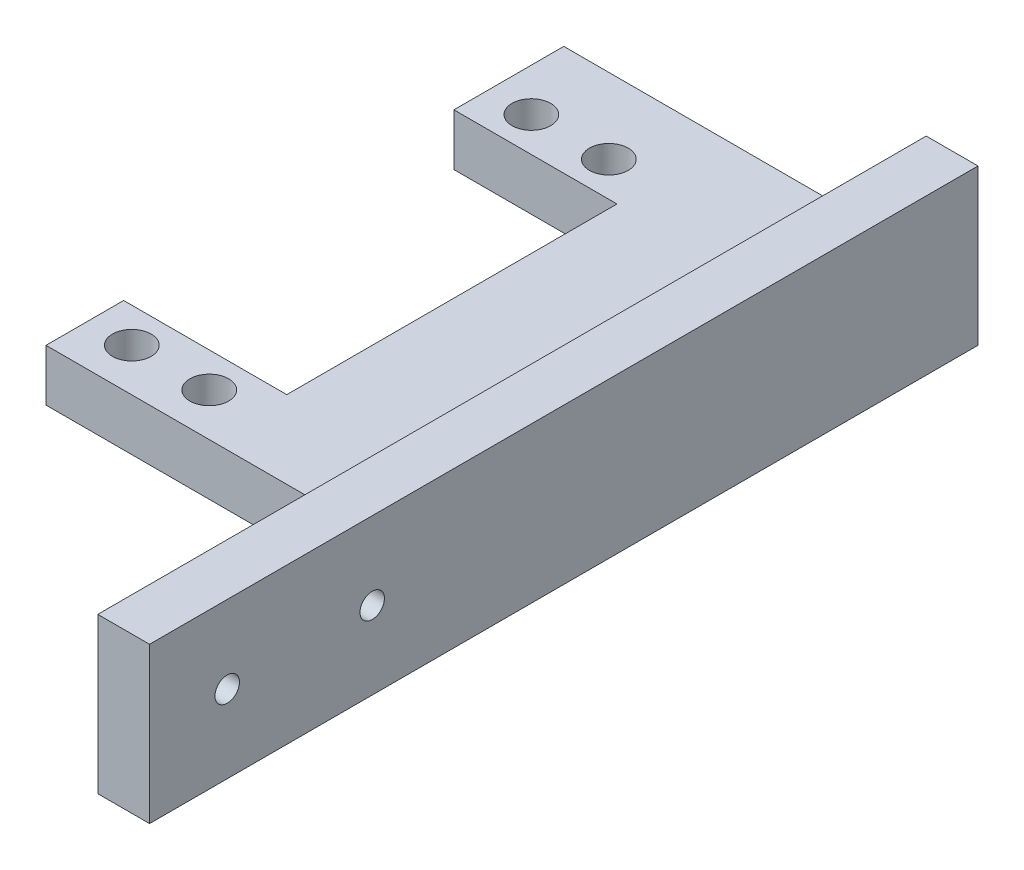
ISO-10303-21;
HEADER;
FILE_DESCRIPTION(('STEP AP214'),'2;1');
FILE_NAME('part.step','',(''),(''),'','','');
FILE_SCHEMA(('AUTOMOTIVE_DESIGN { 1 0 10303 214 1 1 1 1 }'));
ENDSEC;
DATA;
#1=APPLICATION_CONTEXT('core data for automotive mechanical design processes');
#2=APPLICATION_PROTOCOL_DEFINITION('international standard','automotive_design',2000,#1);
#3=PRODUCT_CONTEXT('',#1,'mechanical');
#4=PRODUCT('Part','Part','',(#3));
#5=PRODUCT_RELATED_PRODUCT_CATEGORY('part','',(#4));
#6=PRODUCT_DEFINITION_FORMATION('','',#4);
#7=PRODUCT_DEFINITION_CONTEXT('part definition',#1,'design');
#8=PRODUCT_DEFINITION('design','',#6,#7);
#9=PRODUCT_DEFINITION_SHAPE('','',#8);
#10=(LENGTH_UNIT() NAMED_UNIT(*) SI_UNIT(.MILLI.,.METRE.));
#11=(NAMED_UNIT(*) PLANE_ANGLE_UNIT() SI_UNIT($,.RADIAN.));
#12=(NAMED_UNIT(*) SI_UNIT($,.STERADIAN.) SOLID_ANGLE_UNIT());
#13=UNCERTAINTY_MEASURE_WITH_UNIT(LENGTH_MEASURE(1.E-05),#10,'distance_accuracy_value','');
#14=(GEOMETRIC_REPRESENTATION_CONTEXT(3) GLOBAL_UNCERTAINTY_ASSIGNED_CONTEXT((#13)) GLOBAL_UNIT_ASSIGNED_CONTEXT((#10,
#11,#12)) REPRESENTATION_CONTEXT('',''));
#15=CARTESIAN_POINT('',(0.,0.,0.));
#16=DIRECTION('',(0.,0.,1.));
#17=DIRECTION('',(1.,0.,0.));
#18=AXIS2_PLACEMENT_3D('',#15,#16,#17);
#19=CARTESIAN_POINT('',(-44.45,0.,0.));
#20=DIRECTION('',(1.,0.,0.));
#21=DIRECTION('',(0.,0.,-1.));
#22=AXIS2_PLACEMENT_3D('',#19,#20,#21);
#23=PLANE('',#22);
#24=DIRECTION('',(0.,0.,-1.));
#25=VECTOR('',#24,1.);
#26=CARTESIAN_POINT('',(-44.45,-9.52500000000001,-92.075));
#27=LINE('',#26,#25);
#28=CARTESIAN_POINT('',(-44.45,-9.52500000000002,-78.600000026));
#29=VERTEX_POINT('',#28);
#30=CARTESIAN_POINT('',(-44.45,-9.52500000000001,-92.075));
#31=VERTEX_POINT('',#30);
#32=EDGE_CURVE('E188',#29,#31,#27,.T.);
#33=ORIENTED_EDGE('',*,*,#32,.F.);
#34=DIRECTION('',(0.,1.,0.));
#35=VECTOR('',#34,1.);
#36=CARTESIAN_POINT('',(-44.45,-9.52500000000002,-78.600000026));
#37=LINE('',#36,#35);
#38=CARTESIAN_POINT('',(-44.45,-3.17500000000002,-78.600000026));
#39=VERTEX_POINT('',#38);
#40=EDGE_CURVE('E167',#29,#39,#37,.T.);
#41=ORIENTED_EDGE('',*,*,#40,.T.);
#42=DIRECTION('',(0.,0.,1.));
#43=VECTOR('',#42,1.);
#44=CARTESIAN_POINT('',(-44.45,-3.17500000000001,-92.075));
#45=LINE('',#44,#43);
#46=CARTESIAN_POINT('',(-44.45,-3.17500000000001,-92.075));
#47=VERTEX_POINT('',#46);
#48=EDGE_CURVE('E180',#47,#39,#45,.T.);
#49=ORIENTED_EDGE('',*,*,#48,.F.);
#50=DIRECTION('',(0.,1.,0.));
#51=VECTOR('',#50,1.);
#52=CARTESIAN_POINT('',(-44.45,-9.52500000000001,-92.075));
#53=LINE('',#52,#51);
#54=EDGE_CURVE('E171',#31,#47,#53,.T.);
#55=ORIENTED_EDGE('',*,*,#54,.F.);
#56=EDGE_LOOP('',(#33,#41,#49,#55));
#57=FACE_BOUND('',#56,.T.);
#58=ADVANCED_FACE('F43',(#57),#23,.F.);
#59=CARTESIAN_POINT('',(6.35,0.,0.));
#60=DIRECTION('',(-1.,0.,0.));
#61=DIRECTION('',(0.,0.,1.));
#62=AXIS2_PLACEMENT_3D('',#59,#60,#61);
#63=PLANE('',#62);
#64=DIRECTION('',(0.,0.,-1.));
#65=VECTOR('',#64,1.);
#66=CARTESIAN_POINT('',(6.35,-9.52500000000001,-92.075));
#67=LINE('',#66,#65);
#68=CARTESIAN_POINT('',(6.35,-9.52500000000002,9.525));
#69=VERTEX_POINT('',#68);
#70=CARTESIAN_POINT('',(6.35,-9.52500000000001,-92.075));
#71=VERTEX_POINT('',#70);
#72=EDGE_CURVE('E229',#69,#71,#67,.T.);
#73=ORIENTED_EDGE('',*,*,#72,.T.);
#74=DIRECTION('',(0.,1.,0.));
#75=VECTOR('',#74,1.);
#76=CARTESIAN_POINT('',(6.35,9.525,-92.075));
#77=LINE('',#76,#75);
#78=CARTESIAN_POINT('',(6.35,9.525,-92.075));
#79=VERTEX_POINT('',#78);
#80=EDGE_CURVE('E233',#71,#79,#77,.T.);
#81=ORIENTED_EDGE('',*,*,#80,.T.);
#82=DIRECTION('',(0.,0.,1.));
#83=VECTOR('',#82,1.);
#84=CARTESIAN_POINT('',(6.35,9.525,-92.075));
#85=LINE('',#84,#83);
#86=CARTESIAN_POINT('',(6.35,9.52499999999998,9.525));
#87=VERTEX_POINT('',#86);
#88=EDGE_CURVE('E236',#79,#87,#85,.T.);
#89=ORIENTED_EDGE('',*,*,#88,.T.);
#90=DIRECTION('',(0.,-1.,0.));
#91=VECTOR('',#90,1.);
#92=CARTESIAN_POINT('',(6.35,9.52499999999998,9.525));
#93=LINE('',#92,#91);
#94=EDGE_CURVE('E225',#87,#69,#93,.T.);
#95=ORIENTED_EDGE('',*,*,#94,.T.);
#96=EDGE_LOOP('',(#73,#81,#89,#95));
#97=FACE_BOUND('',#96,.T.);
#98=CARTESIAN_POINT('',(6.35,0.,0.));
#99=DIRECTION('',(1.,0.,0.));
#100=DIRECTION('',(0.,0.,-1.));
#101=AXIS2_PLACEMENT_3D('',#98,#99,#100);
#102=CIRCLE('',#101,1.5);
#103=CARTESIAN_POINT('',(6.35,0.,-1.5));
#104=VERTEX_POINT('',#103);
#105=EDGE_CURVE('E217',#104,#104,#102,.T.);
#106=ORIENTED_EDGE('',*,*,#105,.F.);
#107=EDGE_LOOP('',(#106));
#108=FACE_BOUND('',#107,.T.);
#109=CARTESIAN_POINT('',(6.35,0.,-17.78));
#110=DIRECTION('',(1.,0.,0.));
#111=DIRECTION('',(0.,0.,-1.));
#112=AXIS2_PLACEMENT_3D('',#109,#110,#111);
#113=CIRCLE('',#112,1.5);
#114=CARTESIAN_POINT('',(6.35,0.,-19.28));
#115=VERTEX_POINT('',#114);
#116=EDGE_CURVE('E209',#115,#115,#113,.T.);
#117=ORIENTED_EDGE('',*,*,#116,.F.);
#118=EDGE_LOOP('',(#117));
#119=FACE_BOUND('',#118,.T.);
#120=ADVANCED_FACE('F284',(#97,#108,#119),#63,.F.);
#121=CARTESIAN_POINT('',(0.,0.,0.));
#122=DIRECTION('',(-1.,0.,0.));
#123=DIRECTION('',(0.,0.,1.));
#124=AXIS2_PLACEMENT_3D('',#121,#122,#123);
#125=PLANE('',#124);
#126=DIRECTION('',(0.,1.,0.));
#127=VECTOR('',#126,1.);
#128=CARTESIAN_POINT('',(0.,0.,-28.575));
#129=LINE('',#128,#127);
#130=CARTESIAN_POINT('',(0.,-9.52500000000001,-28.575));
#131=VERTEX_POINT('',#130);
#132=CARTESIAN_POINT('',(0.,-3.17500000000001,-28.575));
#133=VERTEX_POINT('',#132);
#134=EDGE_CURVE('E205',#131,#133,#129,.T.);
#135=ORIENTED_EDGE('',*,*,#134,.F.);
#136=DIRECTION('',(0.,0.,-1.));
#137=VECTOR('',#136,1.);
#138=CARTESIAN_POINT('',(0.,-9.52500000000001,-92.075));
#139=LINE('',#138,#137);
#140=CARTESIAN_POINT('',(0.,-9.52500000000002,9.525));
#141=VERTEX_POINT('',#140);
#142=EDGE_CURVE('E243',#141,#131,#139,.T.);
#143=ORIENTED_EDGE('',*,*,#142,.F.);
#144=DIRECTION('',(0.,-1.,0.));
#145=VECTOR('',#144,1.);
#146=CARTESIAN_POINT('',(0.,9.52499999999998,9.525));
#147=LINE('',#146,#145);
#148=CARTESIAN_POINT('',(0.,9.52499999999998,9.525));
#149=VERTEX_POINT('',#148);
#150=EDGE_CURVE('E221',#149,#141,#147,.T.);
#151=ORIENTED_EDGE('',*,*,#150,.F.);
#152=DIRECTION('',(0.,0.,1.));
#153=VECTOR('',#152,1.);
#154=CARTESIAN_POINT('',(0.,9.525,-92.075));
#155=LINE('',#154,#153);
#156=CARTESIAN_POINT('',(0.,9.525,-92.075));
#157=VERTEX_POINT('',#156);
#158=EDGE_CURVE('E230',#157,#149,#155,.T.);
#159=ORIENTED_EDGE('',*,*,#158,.F.);
#160=DIRECTION('',(0.,1.,0.));
#161=VECTOR('',#160,1.);
#162=CARTESIAN_POINT('',(0.,9.525,-92.075));
#163=LINE('',#162,#161);
#164=CARTESIAN_POINT('',(0.,-3.17500000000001,-92.075));
#165=VERTEX_POINT('',#164);
#166=EDGE_CURVE('E247',#165,#157,#163,.T.);
#167=ORIENTED_EDGE('',*,*,#166,.F.);
#168=DIRECTION('',(0.,0.,-1.));
#169=VECTOR('',#168,1.);
#170=CARTESIAN_POINT('',(0.,-3.17500000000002,0.));
#171=LINE('',#170,#169);
#172=EDGE_CURVE('E67',#133,#165,#171,.T.);
#173=ORIENTED_EDGE('',*,*,#172,.F.);
#174=EDGE_LOOP('',(#135,#143,#151,#159,#167,#173));
#175=FACE_BOUND('',#174,.T.);
#176=CARTESIAN_POINT('',(0.,0.,0.));
#177=DIRECTION('',(1.,0.,0.));
#178=DIRECTION('',(0.,0.,-1.));
#179=AXIS2_PLACEMENT_3D('',#176,#177,#178);
#180=CIRCLE('',#179,1.5);
#181=CARTESIAN_POINT('',(0.,0.,-1.5));
#182=VERTEX_POINT('',#181);
#183=EDGE_CURVE('E213',#182,#182,#180,.T.);
#184=ORIENTED_EDGE('',*,*,#183,.T.);
#185=EDGE_LOOP('',(#184));
#186=FACE_BOUND('',#185,.T.);
#187=CARTESIAN_POINT('',(0.,0.,-17.78));
#188=DIRECTION('',(1.,0.,0.));
#189=DIRECTION('',(0.,0.,-1.));
#190=AXIS2_PLACEMENT_3D('',#187,#188,#189);
#191=CIRCLE('',#190,1.5);
#192=CARTESIAN_POINT('',(0.,0.,-19.28));
#193=VERTEX_POINT('',#192);
#194=EDGE_CURVE('E208',#193,#193,#191,.T.);
#195=ORIENTED_EDGE('',*,*,#194,.T.);
#196=EDGE_LOOP('',(#195));
#197=FACE_BOUND('',#196,.T.);
#198=ADVANCED_FACE('F278',(#175,#186,#197),#125,.T.);
#199=CARTESIAN_POINT('',(6.35,9.52499999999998,9.525));
#200=DIRECTION('',(0.,0.,-1.));
#201=DIRECTION('',(0.,1.,0.));
#202=AXIS2_PLACEMENT_3D('',#199,#200,#201);
#203=PLANE('',#202);
#204=ORIENTED_EDGE('',*,*,#150,.T.);
#205=DIRECTION('',(-1.,0.,0.));
#206=VECTOR('',#205,1.);
#207=CARTESIAN_POINT('',(6.35,-9.52500000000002,9.525));
#208=LINE('',#207,#206);
#209=EDGE_CURVE('E11',#69,#141,#208,.T.);
#210=ORIENTED_EDGE('',*,*,#209,.F.);
#211=ORIENTED_EDGE('',*,*,#94,.F.);
#212=DIRECTION('',(-1.,0.,0.));
#213=VECTOR('',#212,1.);
#214=CARTESIAN_POINT('',(6.35,9.52499999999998,9.525));
#215=LINE('',#214,#213);
#216=EDGE_CURVE('E239',#87,#149,#215,.T.);
#217=ORIENTED_EDGE('',*,*,#216,.T.);
#218=EDGE_LOOP('',(#204,#210,#211,#217));
#219=FACE_BOUND('',#218,.T.);
#220=ADVANCED_FACE('F45',(#219),#203,.F.);
#221=CARTESIAN_POINT('',(6.35,-9.52500000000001,-92.075));
#222=DIRECTION('',(0.,1.,0.));
#223=DIRECTION('',(0.,0.,1.));
#224=AXIS2_PLACEMENT_3D('',#221,#222,#223);
#225=PLANE('',#224);
#226=CARTESIAN_POINT('',(-39.199999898,-9.52500000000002,-82.850000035));
#227=DIRECTION('',(0.,1.,0.));
#228=DIRECTION('',(0.,0.,-1.));
#229=AXIS2_PLACEMENT_3D('',#226,#227,#228);
#230=CIRCLE('',#229,2.37499994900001);
#231=CARTESIAN_POINT('',(-39.199999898,-9.52500000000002,-85.224999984));
#232=VERTEX_POINT('',#231);
#233=EDGE_CURVE('E157',#232,#232,#230,.T.);
#234=ORIENTED_EDGE('',*,*,#233,.T.);
#235=EDGE_LOOP('',(#234));
#236=FACE_BOUND('',#235,.T.);
#237=CARTESIAN_POINT('',(-29.700000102,-9.52500000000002,-82.850000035));
#238=DIRECTION('',(0.,1.,0.));
#239=DIRECTION('',(0.,0.,1.));
#240=AXIS2_PLACEMENT_3D('',#237,#238,#239);
#241=CIRCLE('',#240,2.374999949);
#242=CARTESIAN_POINT('',(-29.700000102,-9.52500000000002,-80.475000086));
#243=VERTEX_POINT('',#242);
#244=EDGE_CURVE('E342',#243,#243,#241,.T.);
#245=ORIENTED_EDGE('',*,*,#244,.T.);
#246=EDGE_LOOP('',(#245));
#247=FACE_BOUND('',#246,.T.);
#248=CARTESIAN_POINT('',(-29.700000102,-9.52500000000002,-33.849999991));
#249=DIRECTION('',(0.,1.,0.));
#250=DIRECTION('',(0.,0.,-1.));
#251=AXIS2_PLACEMENT_3D('',#248,#249,#250);
#252=CIRCLE('',#251,2.374999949);
#253=CARTESIAN_POINT('',(-29.700000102,-9.52500000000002,-36.22499994));
#254=VERTEX_POINT('',#253);
#255=EDGE_CURVE('E346',#254,#254,#252,.T.);
#256=ORIENTED_EDGE('',*,*,#255,.T.);
#257=EDGE_LOOP('',(#256));
#258=FACE_BOUND('',#257,.T.);
#259=CARTESIAN_POINT('',(-39.199999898,-9.52500000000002,-33.849999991));
#260=DIRECTION('',(0.,1.,0.));
#261=DIRECTION('',(0.,0.,1.));
#262=AXIS2_PLACEMENT_3D('',#259,#260,#261);
#263=CIRCLE('',#262,2.374999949);
#264=CARTESIAN_POINT('',(-39.199999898,-9.52500000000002,-31.475000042));
#265=VERTEX_POINT('',#264);
#266=EDGE_CURVE('E349',#265,#265,#263,.T.);
#267=ORIENTED_EDGE('',*,*,#266,.T.);
#268=EDGE_LOOP('',(#267));
#269=FACE_BOUND('',#268,.T.);
#270=DIRECTION('',(0.,0.,-1.));
#271=VECTOR('',#270,1.);
#272=CARTESIAN_POINT('',(-24.45,-9.52500000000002,-78.600000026));
#273=LINE('',#272,#271);
#274=CARTESIAN_POINT('',(-24.45,-9.52500000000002,-38.1));
#275=VERTEX_POINT('',#274);
#276=CARTESIAN_POINT('',(-24.45,-9.52500000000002,-78.600000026));
#277=VERTEX_POINT('',#276);
#278=EDGE_CURVE('E138',#275,#277,#273,.T.);
#279=ORIENTED_EDGE('',*,*,#278,.T.);
#280=DIRECTION('',(-1.,0.,0.));
#281=VECTOR('',#280,1.);
#282=CARTESIAN_POINT('',(-44.45,-9.52500000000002,-78.600000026));
#283=LINE('',#282,#281);
#284=EDGE_CURVE('E144',#277,#29,#283,.T.);
#285=ORIENTED_EDGE('',*,*,#284,.T.);
#286=ORIENTED_EDGE('',*,*,#32,.T.);
#287=DIRECTION('',(-1.,0.,0.));
#288=VECTOR('',#287,1.);
#289=CARTESIAN_POINT('',(6.35,-9.52500000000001,-92.075));
#290=LINE('',#289,#288);
#291=EDGE_CURVE('E52',#71,#31,#290,.T.);
#292=ORIENTED_EDGE('',*,*,#291,.F.);
#293=ORIENTED_EDGE('',*,*,#72,.F.);
#294=ORIENTED_EDGE('',*,*,#209,.T.);
#295=ORIENTED_EDGE('',*,*,#142,.T.);
#296=DIRECTION('',(1.,0.,0.));
#297=VECTOR('',#296,1.);
#298=CARTESIAN_POINT('',(-44.45,-9.52500000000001,-28.575));
#299=LINE('',#298,#297);
#300=CARTESIAN_POINT('',(-44.45,-9.52500000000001,-28.575));
#301=VERTEX_POINT('',#300);
#302=EDGE_CURVE('E192',#301,#131,#299,.T.);
#303=ORIENTED_EDGE('',*,*,#302,.F.);
#304=CARTESIAN_POINT('',(-44.45,-9.52500000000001,-38.1));
#305=VERTEX_POINT('',#304);
#306=EDGE_CURVE('E149',#301,#305,#27,.T.);
#307=ORIENTED_EDGE('',*,*,#306,.T.);
#308=DIRECTION('',(1.,0.,0.));
#309=VECTOR('',#308,1.);
#310=CARTESIAN_POINT('',(-44.45,-9.52500000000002,-38.1));
#311=LINE('',#310,#309);
#312=EDGE_CURVE('E59',#305,#275,#311,.T.);
#313=ORIENTED_EDGE('',*,*,#312,.T.);
#314=EDGE_LOOP('',(#279,#285,#286,#292,#293,#294,#295,#303,#307,#313));
#315=FACE_BOUND('',#314,.T.);
#316=ADVANCED_FACE('F147',(#236,#247,#258,#269,#315),#225,.F.);
#317=CARTESIAN_POINT('',(6.35,9.525,-92.075));
#318=DIRECTION('',(0.,0.,1.));
#319=DIRECTION('',(1.,0.,0.));
#320=AXIS2_PLACEMENT_3D('',#317,#318,#319);
#321=PLANE('',#320);
#322=DIRECTION('',(-1.,0.,0.));
#323=VECTOR('',#322,1.);
#324=CARTESIAN_POINT('',(6.35,9.525,-92.075));
#325=LINE('',#324,#323);
#326=EDGE_CURVE('E255',#79,#157,#325,.T.);
#327=ORIENTED_EDGE('',*,*,#326,.F.);
#328=ORIENTED_EDGE('',*,*,#80,.F.);
#329=ORIENTED_EDGE('',*,*,#291,.T.);
#330=ORIENTED_EDGE('',*,*,#54,.T.);
#331=DIRECTION('',(1.,0.,0.));
#332=VECTOR('',#331,1.);
#333=CARTESIAN_POINT('',(-44.45,-3.17500000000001,-92.075));
#334=LINE('',#333,#332);
#335=EDGE_CURVE('E191',#47,#165,#334,.T.);
#336=ORIENTED_EDGE('',*,*,#335,.T.);
#337=ORIENTED_EDGE('',*,*,#166,.T.);
#338=EDGE_LOOP('',(#327,#328,#329,#330,#336,#337));
#339=FACE_BOUND('',#338,.T.);
#340=ADVANCED_FACE('F265',(#339),#321,.F.);
#341=CARTESIAN_POINT('',(6.35,9.525,-92.075));
#342=DIRECTION('',(0.,-1.,0.));
#343=DIRECTION('',(0.,0.,-1.));
#344=AXIS2_PLACEMENT_3D('',#341,#342,#343);
#345=PLANE('',#344);
#346=ORIENTED_EDGE('',*,*,#158,.T.);
#347=ORIENTED_EDGE('',*,*,#216,.F.);
#348=ORIENTED_EDGE('',*,*,#88,.F.);
#349=ORIENTED_EDGE('',*,*,#326,.T.);
#350=EDGE_LOOP('',(#346,#347,#348,#349));
#351=FACE_BOUND('',#350,.T.);
#352=ADVANCED_FACE('F275',(#351),#345,.F.);
#353=CARTESIAN_POINT('',(6.35,0.,0.));
#354=DIRECTION('',(-1.,0.,0.));
#355=DIRECTION('',(0.,0.,1.));
#356=AXIS2_PLACEMENT_3D('',#353,#354,#355);
#357=CYLINDRICAL_SURFACE('',#356,1.5);
#358=ORIENTED_EDGE('',*,*,#105,.T.);
#359=EDGE_LOOP('',(#358));
#360=FACE_BOUND('',#359,.T.);
#361=ORIENTED_EDGE('',*,*,#183,.F.);
#362=EDGE_LOOP('',(#361));
#363=FACE_BOUND('',#362,.T.);
#364=ADVANCED_FACE('F321',(#360,#363),#357,.F.);
#365=CARTESIAN_POINT('',(6.35,0.,-17.78));
#366=DIRECTION('',(-1.,0.,0.));
#367=DIRECTION('',(0.,0.,1.));
#368=AXIS2_PLACEMENT_3D('',#365,#366,#367);
#369=CYLINDRICAL_SURFACE('',#368,1.5);
#370=ORIENTED_EDGE('',*,*,#116,.T.);
#371=EDGE_LOOP('',(#370));
#372=FACE_BOUND('',#371,.T.);
#373=ORIENTED_EDGE('',*,*,#194,.F.);
#374=EDGE_LOOP('',(#373));
#375=FACE_BOUND('',#374,.T.);
#376=ADVANCED_FACE('F315',(#372,#375),#369,.F.);
#377=CARTESIAN_POINT('',(-44.45,-9.52500000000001,-28.575));
#378=DIRECTION('',(0.,0.,1.));
#379=DIRECTION('',(1.,0.,0.));
#380=AXIS2_PLACEMENT_3D('',#377,#378,#379);
#381=PLANE('',#380);
#382=ORIENTED_EDGE('',*,*,#302,.T.);
#383=ORIENTED_EDGE('',*,*,#134,.T.);
#384=DIRECTION('',(1.,0.,0.));
#385=VECTOR('',#384,1.);
#386=CARTESIAN_POINT('',(-44.45,-3.17500000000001,-28.575));
#387=LINE('',#386,#385);
#388=CARTESIAN_POINT('',(-44.45,-3.17500000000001,-28.575));
#389=VERTEX_POINT('',#388);
#390=EDGE_CURVE('E196',#389,#133,#387,.T.);
#391=ORIENTED_EDGE('',*,*,#390,.F.);
#392=DIRECTION('',(0.,-1.,0.));
#393=VECTOR('',#392,1.);
#394=CARTESIAN_POINT('',(-44.45,-9.52500000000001,-28.575));
#395=LINE('',#394,#393);
#396=EDGE_CURVE('E184',#389,#301,#395,.T.);
#397=ORIENTED_EDGE('',*,*,#396,.T.);
#398=EDGE_LOOP('',(#382,#383,#391,#397));
#399=FACE_BOUND('',#398,.T.);
#400=ADVANCED_FACE('F287',(#399),#381,.T.);
#401=CARTESIAN_POINT('',(-44.45,-3.17500000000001,-92.075));
#402=DIRECTION('',(0.,1.,0.));
#403=DIRECTION('',(0.,0.,1.));
#404=AXIS2_PLACEMENT_3D('',#401,#402,#403);
#405=PLANE('',#404);
#406=CARTESIAN_POINT('',(-39.199999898,-3.17500000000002,-82.850000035));
#407=DIRECTION('',(0.,1.,0.));
#408=DIRECTION('',(0.,0.,-1.));
#409=AXIS2_PLACEMENT_3D('',#406,#407,#408);
#410=CIRCLE('',#409,2.37499994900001);
#411=CARTESIAN_POINT('',(-39.199999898,-3.17500000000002,-85.224999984));
#412=VERTEX_POINT('',#411);
#413=EDGE_CURVE('E368',#412,#412,#410,.T.);
#414=ORIENTED_EDGE('',*,*,#413,.F.);
#415=EDGE_LOOP('',(#414));
#416=FACE_BOUND('',#415,.T.);
#417=CARTESIAN_POINT('',(-29.700000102,-3.17500000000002,-82.850000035));
#418=DIRECTION('',(0.,1.,0.));
#419=DIRECTION('',(0.,0.,1.));
#420=AXIS2_PLACEMENT_3D('',#417,#418,#419);
#421=CIRCLE('',#420,2.374999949);
#422=CARTESIAN_POINT('',(-29.700000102,-3.17500000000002,-80.475000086));
#423=VERTEX_POINT('',#422);
#424=EDGE_CURVE('E363',#423,#423,#421,.T.);
#425=ORIENTED_EDGE('',*,*,#424,.F.);
#426=EDGE_LOOP('',(#425));
#427=FACE_BOUND('',#426,.T.);
#428=CARTESIAN_POINT('',(-29.700000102,-3.17500000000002,-33.849999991));
#429=DIRECTION('',(0.,1.,0.));
#430=DIRECTION('',(0.,0.,-1.));
#431=AXIS2_PLACEMENT_3D('',#428,#429,#430);
#432=CIRCLE('',#431,2.374999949);
#433=CARTESIAN_POINT('',(-29.700000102,-3.17500000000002,-36.22499994));
#434=VERTEX_POINT('',#433);
#435=EDGE_CURVE('E352',#434,#434,#432,.T.);
#436=ORIENTED_EDGE('',*,*,#435,.F.);
#437=EDGE_LOOP('',(#436));
#438=FACE_BOUND('',#437,.T.);
#439=CARTESIAN_POINT('',(-39.199999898,-3.17500000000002,-33.849999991));
#440=DIRECTION('',(0.,1.,0.));
#441=DIRECTION('',(0.,0.,1.));
#442=AXIS2_PLACEMENT_3D('',#439,#440,#441);
#443=CIRCLE('',#442,2.374999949);
#444=CARTESIAN_POINT('',(-39.199999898,-3.17500000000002,-31.475000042));
#445=VERTEX_POINT('',#444);
#446=EDGE_CURVE('E164',#445,#445,#443,.T.);
#447=ORIENTED_EDGE('',*,*,#446,.F.);
#448=EDGE_LOOP('',(#447));
#449=FACE_BOUND('',#448,.T.);
#450=DIRECTION('',(-1.,0.,0.));
#451=VECTOR('',#450,1.);
#452=CARTESIAN_POINT('',(-44.45,-3.17500000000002,-78.600000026));
#453=LINE('',#452,#451);
#454=CARTESIAN_POINT('',(-24.45,-3.17500000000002,-78.600000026));
#455=VERTEX_POINT('',#454);
#456=EDGE_CURVE('E151',#455,#39,#453,.T.);
#457=ORIENTED_EDGE('',*,*,#456,.F.);
#458=DIRECTION('',(0.,0.,-1.));
#459=VECTOR('',#458,1.);
#460=CARTESIAN_POINT('',(-24.45,-3.17500000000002,-78.600000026));
#461=LINE('',#460,#459);
#462=CARTESIAN_POINT('',(-24.45,-3.17500000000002,-38.1));
#463=VERTEX_POINT('',#462);
#464=EDGE_CURVE('E154',#463,#455,#461,.T.);
#465=ORIENTED_EDGE('',*,*,#464,.F.);
#466=DIRECTION('',(1.,0.,0.));
#467=VECTOR('',#466,1.);
#468=CARTESIAN_POINT('',(-44.45,-3.17500000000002,-38.1));
#469=LINE('',#468,#467);
#470=CARTESIAN_POINT('',(-44.45,-3.17500000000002,-38.1));
#471=VERTEX_POINT('',#470);
#472=EDGE_CURVE('E129',#471,#463,#469,.T.);
#473=ORIENTED_EDGE('',*,*,#472,.F.);
#474=EDGE_CURVE('E179',#471,#389,#45,.T.);
#475=ORIENTED_EDGE('',*,*,#474,.T.);
#476=ORIENTED_EDGE('',*,*,#390,.T.);
#477=ORIENTED_EDGE('',*,*,#172,.T.);
#478=ORIENTED_EDGE('',*,*,#335,.F.);
#479=ORIENTED_EDGE('',*,*,#48,.T.);
#480=EDGE_LOOP('',(#457,#465,#473,#475,#476,#477,#478,#479));
#481=FACE_BOUND('',#480,.T.);
#482=ADVANCED_FACE('F271',(#416,#427,#438,#449,#481),#405,.T.);
#483=ORIENTED_EDGE('',*,*,#474,.F.);
#484=DIRECTION('',(0.,1.,0.));
#485=VECTOR('',#484,1.);
#486=CARTESIAN_POINT('',(-44.45,-9.52500000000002,-38.1));
#487=LINE('',#486,#485);
#488=EDGE_CURVE('E135',#305,#471,#487,.T.);
#489=ORIENTED_EDGE('',*,*,#488,.F.);
#490=ORIENTED_EDGE('',*,*,#306,.F.);
#491=ORIENTED_EDGE('',*,*,#396,.F.);
#492=EDGE_LOOP('',(#483,#489,#490,#491));
#493=FACE_BOUND('',#492,.T.);
#494=ADVANCED_FACE('F292',(#493),#23,.F.);
#495=CARTESIAN_POINT('',(-44.45,-9.52500000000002,-78.600000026));
#496=DIRECTION('',(0.,0.,-1.));
#497=DIRECTION('',(-1.,0.,0.));
#498=AXIS2_PLACEMENT_3D('',#495,#496,#497);
#499=PLANE('',#498);
#500=ORIENTED_EDGE('',*,*,#456,.T.);
#501=ORIENTED_EDGE('',*,*,#40,.F.);
#502=ORIENTED_EDGE('',*,*,#284,.F.);
#503=DIRECTION('',(0.,1.,0.));
#504=VECTOR('',#503,1.);
#505=CARTESIAN_POINT('',(-24.45,-9.52500000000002,-78.600000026));
#506=LINE('',#505,#504);
#507=EDGE_CURVE('E134',#277,#455,#506,.T.);
#508=ORIENTED_EDGE('',*,*,#507,.T.);
#509=EDGE_LOOP('',(#500,#501,#502,#508));
#510=FACE_BOUND('',#509,.T.);
#511=ADVANCED_FACE('F296',(#510),#499,.F.);
#512=CARTESIAN_POINT('',(-24.45,-9.52500000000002,-78.600000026));
#513=DIRECTION('',(1.,0.,0.));
#514=DIRECTION('',(0.,0.,-1.));
#515=AXIS2_PLACEMENT_3D('',#512,#513,#514);
#516=PLANE('',#515);
#517=ORIENTED_EDGE('',*,*,#464,.T.);
#518=ORIENTED_EDGE('',*,*,#507,.F.);
#519=ORIENTED_EDGE('',*,*,#278,.F.);
#520=DIRECTION('',(0.,1.,0.));
#521=VECTOR('',#520,1.);
#522=CARTESIAN_POINT('',(-24.45,-9.52500000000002,-38.1));
#523=LINE('',#522,#521);
#524=EDGE_CURVE('E125',#275,#463,#523,.T.);
#525=ORIENTED_EDGE('',*,*,#524,.T.);
#526=EDGE_LOOP('',(#517,#518,#519,#525));
#527=FACE_BOUND('',#526,.T.);
#528=ADVANCED_FACE('F139',(#527),#516,.F.);
#529=CARTESIAN_POINT('',(-44.45,-9.52500000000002,-38.1));
#530=DIRECTION('',(0.,0.,1.));
#531=DIRECTION('',(1.,0.,0.));
#532=AXIS2_PLACEMENT_3D('',#529,#530,#531);
#533=PLANE('',#532);
#534=ORIENTED_EDGE('',*,*,#472,.T.);
#535=ORIENTED_EDGE('',*,*,#524,.F.);
#536=ORIENTED_EDGE('',*,*,#312,.F.);
#537=ORIENTED_EDGE('',*,*,#488,.T.);
#538=EDGE_LOOP('',(#534,#535,#536,#537));
#539=FACE_BOUND('',#538,.T.);
#540=ADVANCED_FACE('F127',(#539),#533,.F.);
#541=CARTESIAN_POINT('',(-39.199999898,-9.52500000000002,-33.849999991));
#542=DIRECTION('',(0.,1.,0.));
#543=DIRECTION('',(0.,0.,1.));
#544=AXIS2_PLACEMENT_3D('',#541,#542,#543);
#545=CYLINDRICAL_SURFACE('',#544,2.374999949);
#546=ORIENTED_EDGE('',*,*,#266,.F.);
#547=EDGE_LOOP('',(#546));
#548=FACE_BOUND('',#547,.T.);
#549=ORIENTED_EDGE('',*,*,#446,.T.);
#550=EDGE_LOOP('',(#549));
#551=FACE_BOUND('',#550,.T.);
#552=ADVANCED_FACE('F382',(#548,#551),#545,.F.);
#553=CARTESIAN_POINT('',(-29.700000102,-9.52500000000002,-33.849999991));
#554=DIRECTION('',(0.,1.,0.));
#555=DIRECTION('',(0.,0.,1.));
#556=AXIS2_PLACEMENT_3D('',#553,#554,#555);
#557=CYLINDRICAL_SURFACE('',#556,2.374999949);
#558=ORIENTED_EDGE('',*,*,#255,.F.);
#559=EDGE_LOOP('',(#558));
#560=FACE_BOUND('',#559,.T.);
#561=ORIENTED_EDGE('',*,*,#435,.T.);
#562=EDGE_LOOP('',(#561));
#563=FACE_BOUND('',#562,.T.);
#564=ADVANCED_FACE('F384',(#560,#563),#557,.F.);
#565=CARTESIAN_POINT('',(-29.700000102,-9.52500000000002,-82.850000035));
#566=DIRECTION('',(0.,1.,0.));
#567=DIRECTION('',(0.,0.,1.));
#568=AXIS2_PLACEMENT_3D('',#565,#566,#567);
#569=CYLINDRICAL_SURFACE('',#568,2.374999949);
#570=ORIENTED_EDGE('',*,*,#244,.F.);
#571=EDGE_LOOP('',(#570));
#572=FACE_BOUND('',#571,.T.);
#573=ORIENTED_EDGE('',*,*,#424,.T.);
#574=EDGE_LOOP('',(#573));
#575=FACE_BOUND('',#574,.T.);
#576=ADVANCED_FACE('F390',(#572,#575),#569,.F.);
#577=CARTESIAN_POINT('',(-39.199999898,-9.52500000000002,-82.850000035));
#578=DIRECTION('',(0.,1.,0.));
#579=DIRECTION('',(0.,0.,1.));
#580=AXIS2_PLACEMENT_3D('',#577,#578,#579);
#581=CYLINDRICAL_SURFACE('',#580,2.37499994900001);
#582=ORIENTED_EDGE('',*,*,#233,.F.);
#583=EDGE_LOOP('',(#582));
#584=FACE_BOUND('',#583,.T.);
#585=ORIENTED_EDGE('',*,*,#413,.T.);
#586=EDGE_LOOP('',(#585));
#587=FACE_BOUND('',#586,.T.);
#588=ADVANCED_FACE('F374',(#584,#587),#581,.F.);
#589=CLOSED_SHELL('',(#58,#120,#198,#220,#316,#340,#352,#364,#376,#400,#482,#494,#511,#528,#540,
#552,#564,#576,#588));
#590=MANIFOLD_SOLID_BREP('B2',#589);
#591=ADVANCED_BREP_SHAPE_REPRESENTATION('',(#18,#590),#14);
#592=SHAPE_DEFINITION_REPRESENTATION(#9,#591);
ENDSEC;
END-ISO-10303-21;
